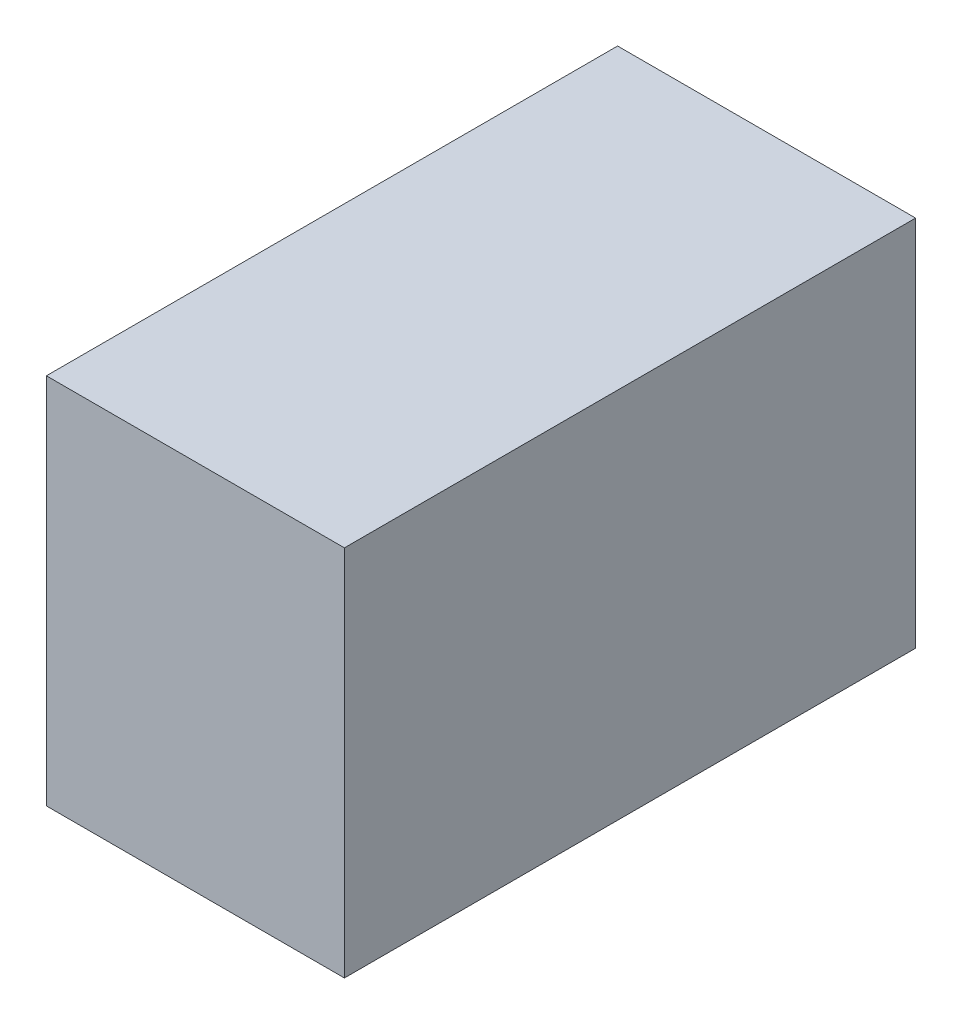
ISO-10303-21;
HEADER;
FILE_DESCRIPTION(('STEP AP214'),'2;1');
FILE_NAME('part.step','',(''),(''),'','','');
FILE_SCHEMA(('AUTOMOTIVE_DESIGN { 1 0 10303 214 1 1 1 1 }'));
ENDSEC;
DATA;
#1=APPLICATION_CONTEXT('core data for automotive mechanical design processes');
#2=APPLICATION_PROTOCOL_DEFINITION('international standard','automotive_design',2000,#1);
#3=PRODUCT_CONTEXT('',#1,'mechanical');
#4=PRODUCT('Part','Part','',(#3));
#5=PRODUCT_RELATED_PRODUCT_CATEGORY('part','',(#4));
#6=PRODUCT_DEFINITION_FORMATION('','',#4);
#7=PRODUCT_DEFINITION_CONTEXT('part definition',#1,'design');
#8=PRODUCT_DEFINITION('design','',#6,#7);
#9=PRODUCT_DEFINITION_SHAPE('','',#8);
#10=(LENGTH_UNIT() NAMED_UNIT(*) SI_UNIT(.MILLI.,.METRE.));
#11=(NAMED_UNIT(*) PLANE_ANGLE_UNIT() SI_UNIT($,.RADIAN.));
#12=(NAMED_UNIT(*) SI_UNIT($,.STERADIAN.) SOLID_ANGLE_UNIT());
#13=UNCERTAINTY_MEASURE_WITH_UNIT(LENGTH_MEASURE(1.E-05),#10,'distance_accuracy_value','');
#14=(GEOMETRIC_REPRESENTATION_CONTEXT(3) GLOBAL_UNCERTAINTY_ASSIGNED_CONTEXT((#13)) GLOBAL_UNIT_ASSIGNED_CONTEXT((#10,
#11,#12)) REPRESENTATION_CONTEXT('',''));
#15=CARTESIAN_POINT('',(0.,0.,0.));
#16=DIRECTION('',(0.,0.,1.));
#17=DIRECTION('',(1.,0.,0.));
#18=AXIS2_PLACEMENT_3D('',#15,#16,#17);
#19=CARTESIAN_POINT('',(30.,37.5,-57.5));
#20=DIRECTION('',(-1.,0.,0.));
#21=DIRECTION('',(0.,0.,1.));
#22=AXIS2_PLACEMENT_3D('',#19,#20,#21);
#23=PLANE('',#22);
#24=DIRECTION('',(0.,0.,-1.));
#25=VECTOR('',#24,1.);
#26=CARTESIAN_POINT('',(30.,-37.5,-57.5));
#27=LINE('',#26,#25);
#28=CARTESIAN_POINT('',(30.,-37.5,57.5));
#29=VERTEX_POINT('',#28);
#30=CARTESIAN_POINT('',(30.,-37.5,-57.5));
#31=VERTEX_POINT('',#30);
#32=EDGE_CURVE('E107',#29,#31,#27,.T.);
#33=ORIENTED_EDGE('',*,*,#32,.T.);
#34=DIRECTION('',(0.,-1.,0.));
#35=VECTOR('',#34,1.);
#36=CARTESIAN_POINT('',(30.,37.5,-57.5));
#37=LINE('',#36,#35);
#38=CARTESIAN_POINT('',(30.,37.5,-57.5));
#39=VERTEX_POINT('',#38);
#40=EDGE_CURVE('E11',#39,#31,#37,.T.);
#41=ORIENTED_EDGE('',*,*,#40,.F.);
#42=DIRECTION('',(0.,0.,-1.));
#43=VECTOR('',#42,1.);
#44=CARTESIAN_POINT('',(30.,37.5,-57.5));
#45=LINE('',#44,#43);
#46=CARTESIAN_POINT('',(30.,37.5,57.5));
#47=VERTEX_POINT('',#46);
#48=EDGE_CURVE('E91',#47,#39,#45,.T.);
#49=ORIENTED_EDGE('',*,*,#48,.F.);
#50=DIRECTION('',(0.,-1.,0.));
#51=VECTOR('',#50,1.);
#52=CARTESIAN_POINT('',(30.,37.5,57.5));
#53=LINE('',#52,#51);
#54=EDGE_CURVE('E103',#47,#29,#53,.T.);
#55=ORIENTED_EDGE('',*,*,#54,.T.);
#56=EDGE_LOOP('',(#33,#41,#49,#55));
#57=FACE_BOUND('',#56,.T.);
#58=ADVANCED_FACE('F39',(#57),#23,.F.);
#59=CARTESIAN_POINT('',(-30.,37.5,-57.5));
#60=DIRECTION('',(0.,0.,1.));
#61=DIRECTION('',(1.,0.,0.));
#62=AXIS2_PLACEMENT_3D('',#59,#60,#61);
#63=PLANE('',#62);
#64=DIRECTION('',(-1.,0.,0.));
#65=VECTOR('',#64,1.);
#66=CARTESIAN_POINT('',(-30.,-37.5,-57.5));
#67=LINE('',#66,#65);
#68=CARTESIAN_POINT('',(-30.,-37.5,-57.5));
#69=VERTEX_POINT('',#68);
#70=EDGE_CURVE('E96',#31,#69,#67,.T.);
#71=ORIENTED_EDGE('',*,*,#70,.T.);
#72=DIRECTION('',(0.,-1.,0.));
#73=VECTOR('',#72,1.);
#74=CARTESIAN_POINT('',(-30.,37.5,-57.5));
#75=LINE('',#74,#73);
#76=CARTESIAN_POINT('',(-30.,37.5,-57.5));
#77=VERTEX_POINT('',#76);
#78=EDGE_CURVE('E48',#77,#69,#75,.T.);
#79=ORIENTED_EDGE('',*,*,#78,.F.);
#80=DIRECTION('',(-1.,0.,0.));
#81=VECTOR('',#80,1.);
#82=CARTESIAN_POINT('',(-30.,37.5,-57.5));
#83=LINE('',#82,#81);
#84=EDGE_CURVE('E86',#39,#77,#83,.T.);
#85=ORIENTED_EDGE('',*,*,#84,.F.);
#86=ORIENTED_EDGE('',*,*,#40,.T.);
#87=EDGE_LOOP('',(#71,#79,#85,#86));
#88=FACE_BOUND('',#87,.T.);
#89=ADVANCED_FACE('F95',(#88),#63,.F.);
#90=CARTESIAN_POINT('',(-30.,37.5,-57.5));
#91=DIRECTION('',(1.,0.,0.));
#92=DIRECTION('',(0.,0.,-1.));
#93=AXIS2_PLACEMENT_3D('',#90,#91,#92);
#94=PLANE('',#93);
#95=DIRECTION('',(0.,0.,1.));
#96=VECTOR('',#95,1.);
#97=CARTESIAN_POINT('',(-30.,-37.5,-57.5));
#98=LINE('',#97,#96);
#99=CARTESIAN_POINT('',(-30.,-37.5,57.5));
#100=VERTEX_POINT('',#99);
#101=EDGE_CURVE('E73',#69,#100,#98,.T.);
#102=ORIENTED_EDGE('',*,*,#101,.T.);
#103=DIRECTION('',(0.,-1.,0.));
#104=VECTOR('',#103,1.);
#105=CARTESIAN_POINT('',(-30.,37.5,57.5));
#106=LINE('',#105,#104);
#107=CARTESIAN_POINT('',(-30.,37.5,57.5));
#108=VERTEX_POINT('',#107);
#109=EDGE_CURVE('E98',#108,#100,#106,.T.);
#110=ORIENTED_EDGE('',*,*,#109,.F.);
#111=DIRECTION('',(0.,0.,1.));
#112=VECTOR('',#111,1.);
#113=CARTESIAN_POINT('',(-30.,37.5,-57.5));
#114=LINE('',#113,#112);
#115=EDGE_CURVE('E89',#77,#108,#114,.T.);
#116=ORIENTED_EDGE('',*,*,#115,.F.);
#117=ORIENTED_EDGE('',*,*,#78,.T.);
#118=EDGE_LOOP('',(#102,#110,#116,#117));
#119=FACE_BOUND('',#118,.T.);
#120=ADVANCED_FACE('F99',(#119),#94,.F.);
#121=CARTESIAN_POINT('',(-30.,37.5,57.5));
#122=DIRECTION('',(0.,0.,-1.));
#123=DIRECTION('',(-1.,0.,0.));
#124=AXIS2_PLACEMENT_3D('',#121,#122,#123);
#125=PLANE('',#124);
#126=DIRECTION('',(1.,0.,0.));
#127=VECTOR('',#126,1.);
#128=CARTESIAN_POINT('',(-30.,-37.5,57.5));
#129=LINE('',#128,#127);
#130=EDGE_CURVE('E79',#100,#29,#129,.T.);
#131=ORIENTED_EDGE('',*,*,#130,.T.);
#132=ORIENTED_EDGE('',*,*,#54,.F.);
#133=DIRECTION('',(1.,0.,0.));
#134=VECTOR('',#133,1.);
#135=CARTESIAN_POINT('',(-30.,37.5,57.5));
#136=LINE('',#135,#134);
#137=EDGE_CURVE('E56',#108,#47,#136,.T.);
#138=ORIENTED_EDGE('',*,*,#137,.F.);
#139=ORIENTED_EDGE('',*,*,#109,.T.);
#140=EDGE_LOOP('',(#131,#132,#138,#139));
#141=FACE_BOUND('',#140,.T.);
#142=ADVANCED_FACE('F120',(#141),#125,.F.);
#143=CARTESIAN_POINT('',(0.,37.5,0.));
#144=DIRECTION('',(0.,1.,0.));
#145=DIRECTION('',(0.,0.,1.));
#146=AXIS2_PLACEMENT_3D('',#143,#144,#145);
#147=PLANE('',#146);
#148=ORIENTED_EDGE('',*,*,#48,.T.);
#149=ORIENTED_EDGE('',*,*,#84,.T.);
#150=ORIENTED_EDGE('',*,*,#115,.T.);
#151=ORIENTED_EDGE('',*,*,#137,.T.);
#152=EDGE_LOOP('',(#148,#149,#150,#151));
#153=FACE_BOUND('',#152,.T.);
#154=ADVANCED_FACE('F87',(#153),#147,.T.);
#155=CARTESIAN_POINT('',(0.,-37.5,0.));
#156=DIRECTION('',(0.,1.,0.));
#157=DIRECTION('',(0.,0.,1.));
#158=AXIS2_PLACEMENT_3D('',#155,#156,#157);
#159=PLANE('',#158);
#160=ORIENTED_EDGE('',*,*,#32,.F.);
#161=ORIENTED_EDGE('',*,*,#130,.F.);
#162=ORIENTED_EDGE('',*,*,#101,.F.);
#163=ORIENTED_EDGE('',*,*,#70,.F.);
#164=EDGE_LOOP('',(#160,#161,#162,#163));
#165=FACE_BOUND('',#164,.T.);
#166=ADVANCED_FACE('F123',(#165),#159,.F.);
#167=CLOSED_SHELL('',(#58,#89,#120,#142,#154,#166));
#168=MANIFOLD_SOLID_BREP('B2',#167);
#169=ADVANCED_BREP_SHAPE_REPRESENTATION('',(#18,#168),#14);
#170=SHAPE_DEFINITION_REPRESENTATION(#9,#169);
ENDSEC;
END-ISO-10303-21;
